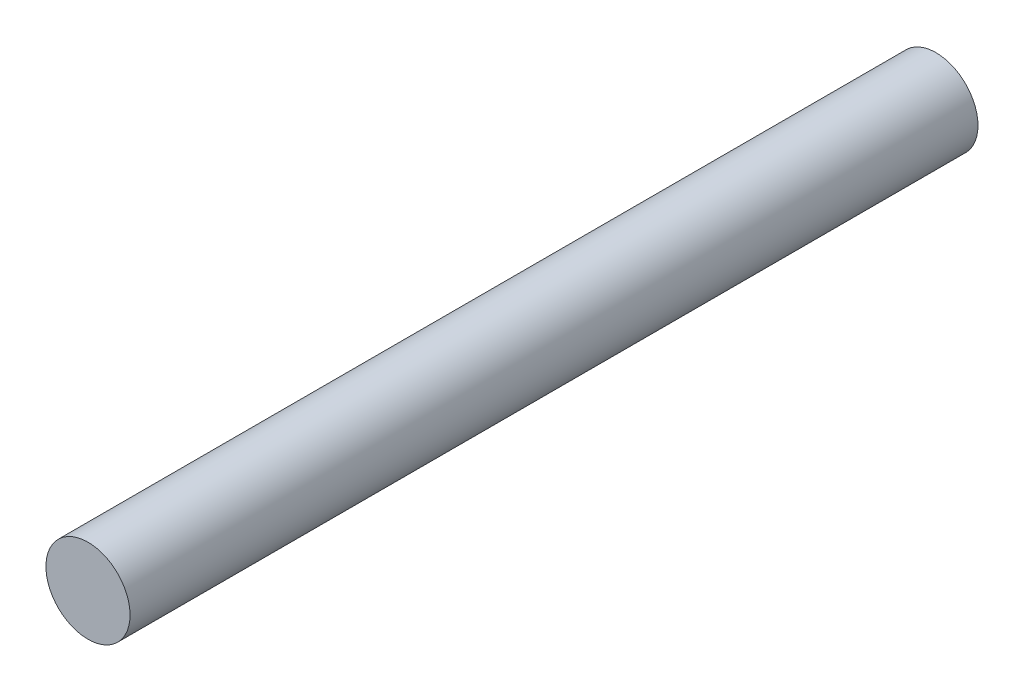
from build123d import *

# Parameters (mm, degrees)
SKETCH2_R           = 25
BOSS_EXTRUDE1_DEPTH = 504


with BuildPart() as part:
    # Sketch2 → Boss-Extrude1 (new body)
    with BuildSketch(Plane.XY):
        Circle(SKETCH2_R)
    extrude(amount=BOSS_EXTRUDE1_DEPTH)


solid = part.part
